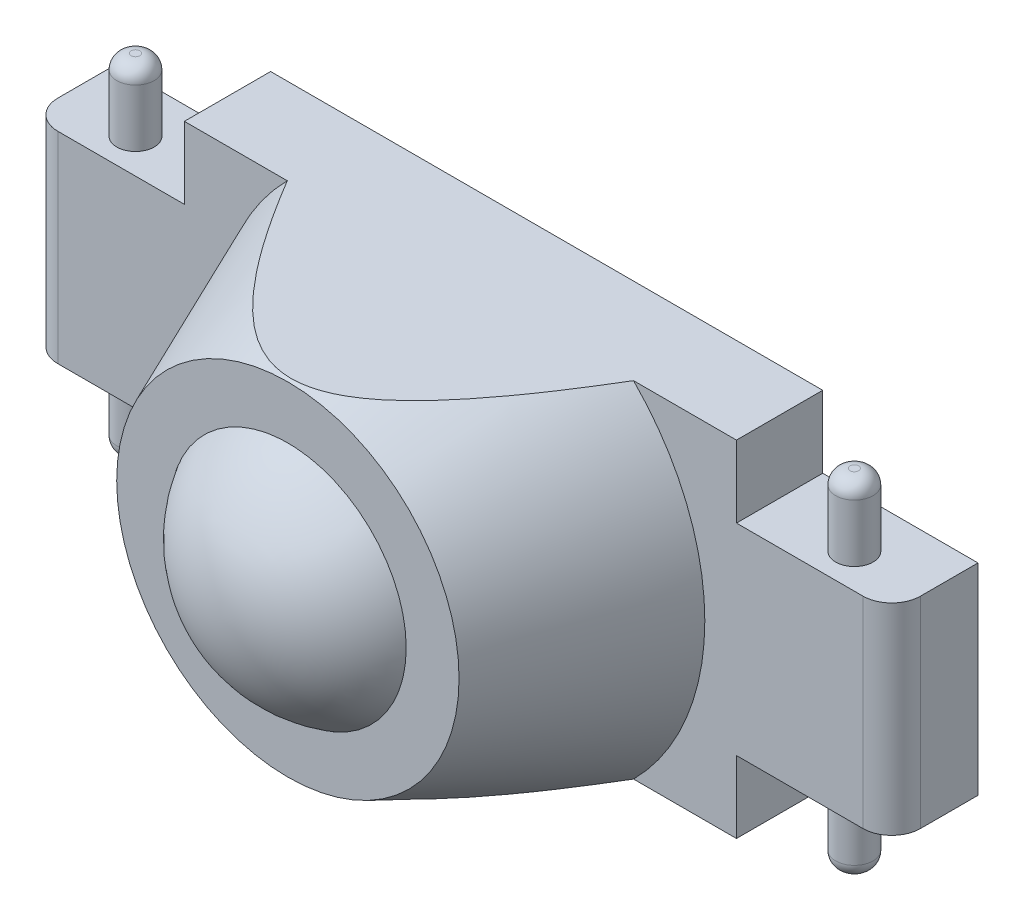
from build123d import *

# Parameters (mm, degrees)
ESQUISSE1_R             = 4.775
BOSS_EXTRU_1_DEPTH      = 3
ESQUISSE3_R             = 8.5
BOSS_EXTRU_2_DEPTH      = 6
BOSS_EXTRU_2_TAPER      = 23
ENL_V_MAT_EXTRU_1_DEPTH = 19.255136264
ESQUISSE7_R             = 0.65
ENL_V_MAT_EXTRU_2_DEPTH = 15
CONG_1_R                = 1
ESQUISSE9_R             = 0.65
BOSS_EXTRU_3_DEPTH      = 6
BOSS_EXTRU_3_2_DEPTH    = 6
CONG_2_R                = 0.5
CONG_3_R                = 0.5


with BuildPart() as part:
    # Esquisse1 → Boss.-Extru.1 (new body)
    with BuildSketch(Plane.XY):
        Polygon((-15, 3.5), (-9.6, 3.5), (-9.6, 6), (9.6, 6), (9.6, 3.5), (15, 3.5), (15, -3.5), (9.6, -3.5), (9.6, -6), (-9.6, -6), (-9.6, -3.5), (-15, -3.5), align=None)
        Circle(ESQUISSE1_R, mode=Mode.SUBTRACT)
    extrude(amount=BOSS_EXTRU_1_DEPTH)

    # Esquisse3 → Boss.-Extru.2 (add)
    with BuildSketch(Plane.XY.offset(3)):
        Circle(ESQUISSE3_R)
    extrude(amount=BOSS_EXTRU_2_DEPTH, taper=BOSS_EXTRU_2_TAPER)

    # Esquisse4 → Enl_v. mat.-Extru.1 (cut, through all)
    with BuildSketch(Plane(origin=(0, 0, 3), x_dir=(-1, 0, 0), z_dir=(0, 0, -1))):
        with BuildLine():
            Line((6.020797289, -6), (-6.020797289, -6))
            ThreePointArc((-6.020797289, -6), (0, -8.5), (6.020797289, -6))
        make_face()
        with BuildLine():
            Line((-6.020797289, 6), (6.020797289, 6))
            ThreePointArc((6.020797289, 6), (0, 8.5), (-6.020797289, 6))
        make_face()
    extrude(amount=-ENL_V_MAT_EXTRU_1_DEPTH, mode=Mode.SUBTRACT)

    # Esquisse6 → Enl_vement de mati_re-R_volution1 (revolve, cut)
    with BuildSketch(Plane(origin=(0, 0, 0), x_dir=(1, 0, 0), z_dir=(0, 1, 0))):
        with BuildLine():
            Line((-4.775, -3), (-4.775, 0))
            Line((-4.775, 0), (0, 0))
            Line((0, 0), (0, -11.35))
            ThreePointArc((0, -11.35), (-3.37643488, -9.95143488), (-4.775, -6.575))
            Line((-4.775, -6.575), (-4.775, -3))
        make_face()
    revolve(axis=Axis((0, 0, 0), (0, 0, 1)), mode=Mode.SUBTRACT)

    # Esquisse7 → Enl_v. mat.-Extru.2 (cut, symmetric)
    with BuildSketch(Plane(origin=(0, 0, 0), x_dir=(1, 0, 0), z_dir=(0, 1, 0))):
        with Locations(Location((-12.5, -1.8, 0), (0, 0, 180))):
            Circle(ESQUISSE7_R)
        with Locations((12.5, -1.8)):
            Circle(ESQUISSE7_R)
    extrude(amount=ENL_V_MAT_EXTRU_2_DEPTH, both=True, mode=Mode.SUBTRACT)

    # Cong_1
    cong_1_edges = [part.edges().sort_by_distance(p)[0] for p in [
        (15, 0, 3),
        (-15, 0, 3),
    ]]
    fillet(cong_1_edges, radius=CONG_1_R)


with BuildPart() as body_2:
    # Esquisse8 → R_volution1 (revolve)
    with BuildSketch(Plane(origin=(0, 0, 0), x_dir=(1, 0, 0), z_dir=(0, 1, 0)), mode=Mode.PRIVATE) as r_volution1_sk:
        with BuildLine():
            Line((0, -11.35), (0, -1.8))
            Line((0, -1.8), (-4.275, -1.8))
            ThreePointArc((-4.275, -1.8), (-4.628553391, -1.946446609), (-4.775, -2.3))
            Line((-4.775, -2.3), (-4.775, -6.575))
            ThreePointArc((-4.775, -6.575), (-3.37643488, -9.95143488), (0, -11.35))
        make_face()
    revolve(r_volution1_sk.sketch.rotate(Axis((0, 0, 11.35), (0, 0, -1)), 180), axis=Axis((0, 0, 11.35), (0, 0, -1)))


with BuildPart() as body_3:
    # Esquisse9 → Boss.-Extru.3 (new, symmetric)
    with BuildSketch(Plane(origin=(0, 0, 0), x_dir=(1, 0, 0), z_dir=(0, 1, 0))):
        with Locations(Location((-12.5, -1.8, 0), (0, 0, 270))):
            Circle(ESQUISSE9_R)
    extrude(amount=BOSS_EXTRU_3_DEPTH, both=True)

    # Cong_2
    cong_2_edges = [body_3.edges().sort_by_distance(p)[0] for p in [
        (-12.5, -6, 1.15),
        (-12.5, 6, 1.15),
    ]]
    fillet(cong_2_edges, radius=CONG_2_R)


with BuildPart() as body_4:
    # Esquisse9 → Boss.-Extru.3 2 (new, symmetric)
    with BuildSketch(Plane(origin=(0, 0, 0), x_dir=(1, 0, 0), z_dir=(0, 1, 0))):
        with Locations(Location((12.5, -1.8, 0), (0, 0, 270))):
            Circle(ESQUISSE9_R)
    extrude(amount=BOSS_EXTRU_3_2_DEPTH, both=True)

    # Cong_3
    cong_3_edges = [body_4.edges().sort_by_distance(p)[0] for p in [
        (12.5, -6, 1.15),
        (12.5, 6, 1.15),
    ]]
    fillet(cong_3_edges, radius=CONG_3_R)


solid = Compound([part.part, body_2.part, body_3.part, body_4.part])
